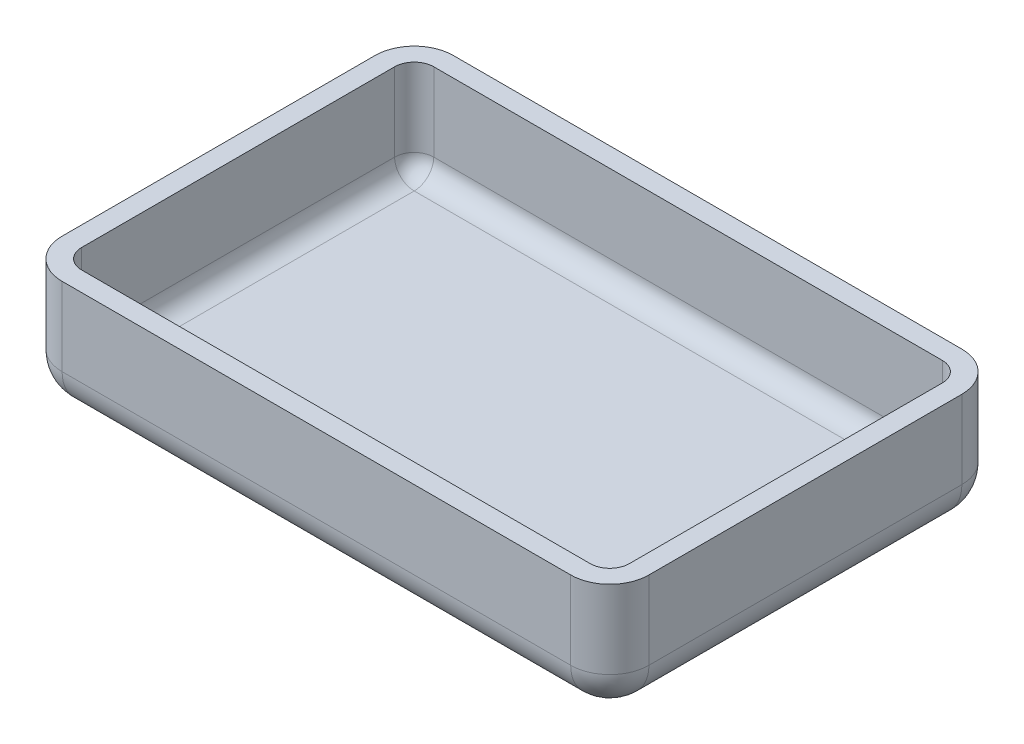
ISO-10303-21;
HEADER;
FILE_DESCRIPTION(('STEP AP214'),'2;1');
FILE_NAME('part.step','',(''),(''),'','','');
FILE_SCHEMA(('AUTOMOTIVE_DESIGN { 1 0 10303 214 1 1 1 1 }'));
ENDSEC;
DATA;
#1=APPLICATION_CONTEXT('core data for automotive mechanical design processes');
#2=APPLICATION_PROTOCOL_DEFINITION('international standard','automotive_design',2000,#1);
#3=PRODUCT_CONTEXT('',#1,'mechanical');
#4=PRODUCT('Part','Part','',(#3));
#5=PRODUCT_RELATED_PRODUCT_CATEGORY('part','',(#4));
#6=PRODUCT_DEFINITION_FORMATION('','',#4);
#7=PRODUCT_DEFINITION_CONTEXT('part definition',#1,'design');
#8=PRODUCT_DEFINITION('design','',#6,#7);
#9=PRODUCT_DEFINITION_SHAPE('','',#8);
#10=(LENGTH_UNIT() NAMED_UNIT(*) SI_UNIT(.MILLI.,.METRE.));
#11=(NAMED_UNIT(*) PLANE_ANGLE_UNIT() SI_UNIT($,.RADIAN.));
#12=(NAMED_UNIT(*) SI_UNIT($,.STERADIAN.) SOLID_ANGLE_UNIT());
#13=UNCERTAINTY_MEASURE_WITH_UNIT(LENGTH_MEASURE(1.E-05),#10,'distance_accuracy_value','');
#14=(GEOMETRIC_REPRESENTATION_CONTEXT(3) GLOBAL_UNCERTAINTY_ASSIGNED_CONTEXT((#13)) GLOBAL_UNIT_ASSIGNED_CONTEXT((#10,
#11,#12)) REPRESENTATION_CONTEXT('',''));
#15=CARTESIAN_POINT('',(0.,0.,0.));
#16=DIRECTION('',(0.,0.,1.));
#17=DIRECTION('',(1.,0.,0.));
#18=AXIS2_PLACEMENT_3D('',#15,#16,#17);
#19=CARTESIAN_POINT('',(-75.,30.,-50.));
#20=DIRECTION('',(1.,0.,0.));
#21=DIRECTION('',(0.,0.,-1.));
#22=AXIS2_PLACEMENT_3D('',#19,#20,#21);
#23=PLANE('',#22);
#24=DIRECTION('',(0.,0.,1.));
#25=VECTOR('',#24,1.);
#26=CARTESIAN_POINT('',(-75.,30.,-50.));
#27=LINE('',#26,#25);
#28=CARTESIAN_POINT('',(-75.,30.,-40.));
#29=VERTEX_POINT('',#28);
#30=CARTESIAN_POINT('',(-75.,30.,40.));
#31=VERTEX_POINT('',#30);
#32=EDGE_CURVE('E307',#29,#31,#27,.T.);
#33=ORIENTED_EDGE('',*,*,#32,.F.);
#34=DIRECTION('',(0.,-1.,0.));
#35=VECTOR('',#34,1.);
#36=CARTESIAN_POINT('',(-75.,30.,-40.));
#37=LINE('',#36,#35);
#38=CARTESIAN_POINT('',(-75.,10.,-40.));
#39=VERTEX_POINT('',#38);
#40=EDGE_CURVE('E54',#29,#39,#37,.T.);
#41=ORIENTED_EDGE('',*,*,#40,.T.);
#42=DIRECTION('',(0.,0.,1.));
#43=VECTOR('',#42,1.);
#44=CARTESIAN_POINT('',(-75.,10.,-50.));
#45=LINE('',#44,#43);
#46=CARTESIAN_POINT('',(-75.,10.,40.));
#47=VERTEX_POINT('',#46);
#48=EDGE_CURVE('E349',#39,#47,#45,.T.);
#49=ORIENTED_EDGE('',*,*,#48,.T.);
#50=DIRECTION('',(0.,-1.,0.));
#51=VECTOR('',#50,1.);
#52=CARTESIAN_POINT('',(-75.,30.,40.));
#53=LINE('',#52,#51);
#54=EDGE_CURVE('E347',#47,#31,#53,.F.);
#55=ORIENTED_EDGE('',*,*,#54,.T.);
#56=EDGE_LOOP('',(#33,#41,#49,#55));
#57=FACE_BOUND('',#56,.T.);
#58=ADVANCED_FACE('F32',(#57),#23,.F.);
#59=CARTESIAN_POINT('',(-75.,30.,50.));
#60=DIRECTION('',(0.,0.,-1.));
#61=DIRECTION('',(-1.,0.,0.));
#62=AXIS2_PLACEMENT_3D('',#59,#60,#61);
#63=PLANE('',#62);
#64=DIRECTION('',(1.,0.,0.));
#65=VECTOR('',#64,1.);
#66=CARTESIAN_POINT('',(-75.,30.,50.));
#67=LINE('',#66,#65);
#68=CARTESIAN_POINT('',(-65.,30.,50.));
#69=VERTEX_POINT('',#68);
#70=CARTESIAN_POINT('',(65.,30.,50.));
#71=VERTEX_POINT('',#70);
#72=EDGE_CURVE('E310',#69,#71,#67,.T.);
#73=ORIENTED_EDGE('',*,*,#72,.F.);
#74=DIRECTION('',(0.,-1.,0.));
#75=VECTOR('',#74,1.);
#76=CARTESIAN_POINT('',(-65.,30.,50.));
#77=LINE('',#76,#75);
#78=CARTESIAN_POINT('',(-65.,10.,50.));
#79=VERTEX_POINT('',#78);
#80=EDGE_CURVE('E324',#69,#79,#77,.T.);
#81=ORIENTED_EDGE('',*,*,#80,.T.);
#82=DIRECTION('',(1.,0.,0.));
#83=VECTOR('',#82,1.);
#84=CARTESIAN_POINT('',(-75.,10.,50.));
#85=LINE('',#84,#83);
#86=CARTESIAN_POINT('',(65.,10.,50.));
#87=VERTEX_POINT('',#86);
#88=EDGE_CURVE('E321',#79,#87,#85,.T.);
#89=ORIENTED_EDGE('',*,*,#88,.T.);
#90=DIRECTION('',(0.,-1.,0.));
#91=VECTOR('',#90,1.);
#92=CARTESIAN_POINT('',(65.,30.,50.));
#93=LINE('',#92,#91);
#94=EDGE_CURVE('E319',#87,#71,#93,.F.);
#95=ORIENTED_EDGE('',*,*,#94,.T.);
#96=EDGE_LOOP('',(#73,#81,#89,#95));
#97=FACE_BOUND('',#96,.T.);
#98=ADVANCED_FACE('F364',(#97),#63,.F.);
#99=CARTESIAN_POINT('',(75.,30.,-50.));
#100=DIRECTION('',(-1.,0.,0.));
#101=DIRECTION('',(0.,0.,1.));
#102=AXIS2_PLACEMENT_3D('',#99,#100,#101);
#103=PLANE('',#102);
#104=DIRECTION('',(0.,0.,-1.));
#105=VECTOR('',#104,1.);
#106=CARTESIAN_POINT('',(75.,10.,-50.));
#107=LINE('',#106,#105);
#108=CARTESIAN_POINT('',(75.,10.,40.));
#109=VERTEX_POINT('',#108);
#110=CARTESIAN_POINT('',(75.,10.,-40.));
#111=VERTEX_POINT('',#110);
#112=EDGE_CURVE('E337',#109,#111,#107,.T.);
#113=ORIENTED_EDGE('',*,*,#112,.T.);
#114=DIRECTION('',(0.,-1.,0.));
#115=VECTOR('',#114,1.);
#116=CARTESIAN_POINT('',(75.,30.,-40.));
#117=LINE('',#116,#115);
#118=CARTESIAN_POINT('',(75.,30.,-40.));
#119=VERTEX_POINT('',#118);
#120=EDGE_CURVE('E339',#111,#119,#117,.F.);
#121=ORIENTED_EDGE('',*,*,#120,.T.);
#122=DIRECTION('',(0.,0.,-1.));
#123=VECTOR('',#122,1.);
#124=CARTESIAN_POINT('',(75.,30.,-50.));
#125=LINE('',#124,#123);
#126=CARTESIAN_POINT('',(75.,30.,40.));
#127=VERTEX_POINT('',#126);
#128=EDGE_CURVE('E313',#127,#119,#125,.T.);
#129=ORIENTED_EDGE('',*,*,#128,.F.);
#130=DIRECTION('',(0.,-1.,0.));
#131=VECTOR('',#130,1.);
#132=CARTESIAN_POINT('',(75.,30.,40.));
#133=LINE('',#132,#131);
#134=EDGE_CURVE('E335',#127,#109,#133,.T.);
#135=ORIENTED_EDGE('',*,*,#134,.T.);
#136=EDGE_LOOP('',(#113,#121,#129,#135));
#137=FACE_BOUND('',#136,.T.);
#138=ADVANCED_FACE('F388',(#137),#103,.F.);
#139=CARTESIAN_POINT('',(-75.,30.,-50.));
#140=DIRECTION('',(0.,0.,1.));
#141=DIRECTION('',(1.,0.,0.));
#142=AXIS2_PLACEMENT_3D('',#139,#140,#141);
#143=PLANE('',#142);
#144=DIRECTION('',(-1.,0.,0.));
#145=VECTOR('',#144,1.);
#146=CARTESIAN_POINT('',(-75.,10.,-50.));
#147=LINE('',#146,#145);
#148=CARTESIAN_POINT('',(65.,10.,-50.));
#149=VERTEX_POINT('',#148);
#150=CARTESIAN_POINT('',(-65.,10.,-50.));
#151=VERTEX_POINT('',#150);
#152=EDGE_CURVE('E343',#149,#151,#147,.T.);
#153=ORIENTED_EDGE('',*,*,#152,.T.);
#154=DIRECTION('',(0.,-1.,0.));
#155=VECTOR('',#154,1.);
#156=CARTESIAN_POINT('',(-65.,30.,-50.));
#157=LINE('',#156,#155);
#158=CARTESIAN_POINT('',(-65.,30.,-50.));
#159=VERTEX_POINT('',#158);
#160=EDGE_CURVE('E345',#151,#159,#157,.F.);
#161=ORIENTED_EDGE('',*,*,#160,.T.);
#162=DIRECTION('',(-1.,0.,0.));
#163=VECTOR('',#162,1.);
#164=CARTESIAN_POINT('',(-75.,30.,-50.));
#165=LINE('',#164,#163);
#166=CARTESIAN_POINT('',(65.,30.,-50.));
#167=VERTEX_POINT('',#166);
#168=EDGE_CURVE('E316',#167,#159,#165,.T.);
#169=ORIENTED_EDGE('',*,*,#168,.F.);
#170=DIRECTION('',(0.,-1.,0.));
#171=VECTOR('',#170,1.);
#172=CARTESIAN_POINT('',(65.,30.,-50.));
#173=LINE('',#172,#171);
#174=EDGE_CURVE('E341',#167,#149,#173,.T.);
#175=ORIENTED_EDGE('',*,*,#174,.T.);
#176=EDGE_LOOP('',(#153,#161,#169,#175));
#177=FACE_BOUND('',#176,.T.);
#178=ADVANCED_FACE('F411',(#177),#143,.F.);
#179=CARTESIAN_POINT('',(-75.,30.,50.));
#180=DIRECTION('',(0.,1.,0.));
#181=DIRECTION('',(0.,0.,1.));
#182=AXIS2_PLACEMENT_3D('',#179,#180,#181);
#183=PLANE('',#182);
#184=DIRECTION('',(-1.,0.,0.));
#185=VECTOR('',#184,1.);
#186=CARTESIAN_POINT('',(-75.,30.,-45.));
#187=LINE('',#186,#185);
#188=CARTESIAN_POINT('',(65.,30.,-45.));
#189=VERTEX_POINT('',#188);
#190=CARTESIAN_POINT('',(-65.,30.,-45.));
#191=VERTEX_POINT('',#190);
#192=EDGE_CURVE('E250',#189,#191,#187,.T.);
#193=ORIENTED_EDGE('',*,*,#192,.F.);
#194=CARTESIAN_POINT('',(65.,30.,-40.));
#195=DIRECTION('',(0.,1.,0.));
#196=DIRECTION('',(0.,0.,1.));
#197=AXIS2_PLACEMENT_3D('',#194,#195,#196);
#198=CIRCLE('',#197,5.);
#199=CARTESIAN_POINT('',(70.,30.,-40.));
#200=VERTEX_POINT('',#199);
#201=EDGE_CURVE('E264',#200,#189,#198,.T.);
#202=ORIENTED_EDGE('',*,*,#201,.F.);
#203=DIRECTION('',(0.,0.,-1.));
#204=VECTOR('',#203,1.);
#205=CARTESIAN_POINT('',(70.,30.,-50.));
#206=LINE('',#205,#204);
#207=CARTESIAN_POINT('',(70.,30.,40.));
#208=VERTEX_POINT('',#207);
#209=EDGE_CURVE('E46',#208,#200,#206,.T.);
#210=ORIENTED_EDGE('',*,*,#209,.F.);
#211=CARTESIAN_POINT('',(65.,30.,40.));
#212=DIRECTION('',(0.,1.,0.));
#213=DIRECTION('',(0.,0.,1.));
#214=AXIS2_PLACEMENT_3D('',#211,#212,#213);
#215=CIRCLE('',#214,5.);
#216=CARTESIAN_POINT('',(65.,30.,45.));
#217=VERTEX_POINT('',#216);
#218=EDGE_CURVE('E180',#217,#208,#215,.T.);
#219=ORIENTED_EDGE('',*,*,#218,.F.);
#220=DIRECTION('',(1.,0.,0.));
#221=VECTOR('',#220,1.);
#222=CARTESIAN_POINT('',(-75.,30.,45.));
#223=LINE('',#222,#221);
#224=CARTESIAN_POINT('',(-65.,30.,45.));
#225=VERTEX_POINT('',#224);
#226=EDGE_CURVE('E261',#225,#217,#223,.T.);
#227=ORIENTED_EDGE('',*,*,#226,.F.);
#228=CARTESIAN_POINT('',(-65.,30.,40.));
#229=DIRECTION('',(0.,1.,0.));
#230=DIRECTION('',(0.,0.,1.));
#231=AXIS2_PLACEMENT_3D('',#228,#229,#230);
#232=CIRCLE('',#231,5.);
#233=CARTESIAN_POINT('',(-70.,30.,40.));
#234=VERTEX_POINT('',#233);
#235=EDGE_CURVE('E262',#234,#225,#232,.T.);
#236=ORIENTED_EDGE('',*,*,#235,.F.);
#237=DIRECTION('',(0.,0.,1.));
#238=VECTOR('',#237,1.);
#239=CARTESIAN_POINT('',(-70.,30.,-50.));
#240=LINE('',#239,#238);
#241=CARTESIAN_POINT('',(-70.,30.,-40.));
#242=VERTEX_POINT('',#241);
#243=EDGE_CURVE('E237',#242,#234,#240,.T.);
#244=ORIENTED_EDGE('',*,*,#243,.F.);
#245=CARTESIAN_POINT('',(-65.,30.,-40.));
#246=DIRECTION('',(0.,1.,0.));
#247=DIRECTION('',(0.,0.,1.));
#248=AXIS2_PLACEMENT_3D('',#245,#246,#247);
#249=CIRCLE('',#248,5.);
#250=EDGE_CURVE('E175',#191,#242,#249,.T.);
#251=ORIENTED_EDGE('',*,*,#250,.F.);
#252=EDGE_LOOP('',(#193,#202,#210,#219,#227,#236,#244,#251));
#253=FACE_BOUND('',#252,.T.);
#254=ORIENTED_EDGE('',*,*,#168,.T.);
#255=CARTESIAN_POINT('',(-65.,30.,-40.));
#256=DIRECTION('',(0.,1.,0.));
#257=DIRECTION('',(0.,0.,1.));
#258=AXIS2_PLACEMENT_3D('',#255,#256,#257);
#259=CIRCLE('',#258,10.);
#260=EDGE_CURVE('E11',#159,#29,#259,.T.);
#261=ORIENTED_EDGE('',*,*,#260,.T.);
#262=ORIENTED_EDGE('',*,*,#32,.T.);
#263=CARTESIAN_POINT('',(-65.,30.,40.));
#264=DIRECTION('',(0.,1.,0.));
#265=DIRECTION('',(0.,0.,1.));
#266=AXIS2_PLACEMENT_3D('',#263,#264,#265);
#267=CIRCLE('',#266,10.);
#268=EDGE_CURVE('E39',#31,#69,#267,.T.);
#269=ORIENTED_EDGE('',*,*,#268,.T.);
#270=ORIENTED_EDGE('',*,*,#72,.T.);
#271=CARTESIAN_POINT('',(65.,30.,40.));
#272=DIRECTION('',(0.,1.,0.));
#273=DIRECTION('',(0.,0.,1.));
#274=AXIS2_PLACEMENT_3D('',#271,#272,#273);
#275=CIRCLE('',#274,10.);
#276=EDGE_CURVE('E352',#71,#127,#275,.T.);
#277=ORIENTED_EDGE('',*,*,#276,.T.);
#278=ORIENTED_EDGE('',*,*,#128,.T.);
#279=CARTESIAN_POINT('',(65.,30.,-40.));
#280=DIRECTION('',(0.,1.,0.));
#281=DIRECTION('',(0.,0.,1.));
#282=AXIS2_PLACEMENT_3D('',#279,#280,#281);
#283=CIRCLE('',#282,10.);
#284=EDGE_CURVE('E354',#119,#167,#283,.T.);
#285=ORIENTED_EDGE('',*,*,#284,.T.);
#286=EDGE_LOOP('',(#254,#261,#262,#269,#270,#277,#278,#285));
#287=FACE_BOUND('',#286,.T.);
#288=ADVANCED_FACE('F358',(#253,#287),#183,.T.);
#289=CARTESIAN_POINT('',(-75.,0.,50.));
#290=DIRECTION('',(0.,1.,0.));
#291=DIRECTION('',(0.,0.,1.));
#292=AXIS2_PLACEMENT_3D('',#289,#290,#291);
#293=PLANE('',#292);
#294=DIRECTION('',(0.,0.,-1.));
#295=VECTOR('',#294,1.);
#296=CARTESIAN_POINT('',(65.,0.,50.));
#297=LINE('',#296,#295);
#298=CARTESIAN_POINT('',(65.,0.,-40.));
#299=VERTEX_POINT('',#298);
#300=CARTESIAN_POINT('',(65.,0.,40.));
#301=VERTEX_POINT('',#300);
#302=EDGE_CURVE('E330',#299,#301,#297,.F.);
#303=ORIENTED_EDGE('',*,*,#302,.T.);
#304=DIRECTION('',(1.,0.,0.));
#305=VECTOR('',#304,1.);
#306=CARTESIAN_POINT('',(-75.,0.,40.));
#307=LINE('',#306,#305);
#308=CARTESIAN_POINT('',(-65.,0.,40.));
#309=VERTEX_POINT('',#308);
#310=EDGE_CURVE('E332',#301,#309,#307,.F.);
#311=ORIENTED_EDGE('',*,*,#310,.T.);
#312=DIRECTION('',(0.,0.,1.));
#313=VECTOR('',#312,1.);
#314=CARTESIAN_POINT('',(-65.,0.,50.));
#315=LINE('',#314,#313);
#316=CARTESIAN_POINT('',(-65.,0.,-40.));
#317=VERTEX_POINT('',#316);
#318=EDGE_CURVE('E326',#309,#317,#315,.F.);
#319=ORIENTED_EDGE('',*,*,#318,.T.);
#320=DIRECTION('',(-1.,0.,0.));
#321=VECTOR('',#320,1.);
#322=CARTESIAN_POINT('',(-75.,0.,-40.));
#323=LINE('',#322,#321);
#324=EDGE_CURVE('E328',#317,#299,#323,.F.);
#325=ORIENTED_EDGE('',*,*,#324,.T.);
#326=EDGE_LOOP('',(#303,#311,#319,#325));
#327=FACE_BOUND('',#326,.T.);
#328=ADVANCED_FACE('F403',(#327),#293,.F.);
#329=CARTESIAN_POINT('',(-65.,30.,-40.));
#330=DIRECTION('',(0.,-1.,0.));
#331=DIRECTION('',(0.,0.,-1.));
#332=AXIS2_PLACEMENT_3D('',#329,#330,#331);
#333=CYLINDRICAL_SURFACE('',#332,10.);
#334=ORIENTED_EDGE('',*,*,#260,.F.);
#335=ORIENTED_EDGE('',*,*,#160,.F.);
#336=CARTESIAN_POINT('',(-65.,10.,-40.));
#337=DIRECTION('',(0.,-1.,0.));
#338=DIRECTION('',(0.,0.,-1.));
#339=AXIS2_PLACEMENT_3D('',#336,#337,#338);
#340=CIRCLE('',#339,10.);
#341=EDGE_CURVE('E301',#39,#151,#340,.T.);
#342=ORIENTED_EDGE('',*,*,#341,.F.);
#343=ORIENTED_EDGE('',*,*,#40,.F.);
#344=EDGE_LOOP('',(#334,#335,#342,#343));
#345=FACE_BOUND('',#344,.T.);
#346=ADVANCED_FACE('F415',(#345),#333,.T.);
#347=CARTESIAN_POINT('',(65.,30.,-40.));
#348=DIRECTION('',(0.,-1.,0.));
#349=DIRECTION('',(0.,0.,-1.));
#350=AXIS2_PLACEMENT_3D('',#347,#348,#349);
#351=CYLINDRICAL_SURFACE('',#350,10.);
#352=ORIENTED_EDGE('',*,*,#284,.F.);
#353=ORIENTED_EDGE('',*,*,#120,.F.);
#354=CARTESIAN_POINT('',(65.,10.,-40.));
#355=DIRECTION('',(0.,-1.,0.));
#356=DIRECTION('',(0.,0.,-1.));
#357=AXIS2_PLACEMENT_3D('',#354,#355,#356);
#358=CIRCLE('',#357,10.);
#359=EDGE_CURVE('E298',#149,#111,#358,.T.);
#360=ORIENTED_EDGE('',*,*,#359,.F.);
#361=ORIENTED_EDGE('',*,*,#174,.F.);
#362=EDGE_LOOP('',(#352,#353,#360,#361));
#363=FACE_BOUND('',#362,.T.);
#364=ADVANCED_FACE('F393',(#363),#351,.T.);
#365=CARTESIAN_POINT('',(-75.,10.,-40.));
#366=DIRECTION('',(-1.,0.,0.));
#367=DIRECTION('',(0.,0.,1.));
#368=AXIS2_PLACEMENT_3D('',#365,#366,#367);
#369=CYLINDRICAL_SURFACE('',#368,10.);
#370=CARTESIAN_POINT('',(-65.,10.,-40.));
#371=DIRECTION('',(-1.,0.,0.));
#372=DIRECTION('',(0.,0.,1.));
#373=AXIS2_PLACEMENT_3D('',#370,#371,#372);
#374=CIRCLE('',#373,10.);
#375=EDGE_CURVE('E304',#151,#317,#374,.T.);
#376=ORIENTED_EDGE('',*,*,#375,.F.);
#377=ORIENTED_EDGE('',*,*,#152,.F.);
#378=CARTESIAN_POINT('',(65.,10.,-40.));
#379=DIRECTION('',(1.,0.,0.));
#380=DIRECTION('',(0.,0.,-1.));
#381=AXIS2_PLACEMENT_3D('',#378,#379,#380);
#382=CIRCLE('',#381,10.);
#383=EDGE_CURVE('E295',#299,#149,#382,.T.);
#384=ORIENTED_EDGE('',*,*,#383,.F.);
#385=ORIENTED_EDGE('',*,*,#324,.F.);
#386=EDGE_LOOP('',(#376,#377,#384,#385));
#387=FACE_BOUND('',#386,.T.);
#388=ADVANCED_FACE('F408',(#387),#369,.T.);
#389=CARTESIAN_POINT('',(-65.,10.,-40.));
#390=DIRECTION('',(0.,0.,1.));
#391=DIRECTION('',(1.,0.,0.));
#392=AXIS2_PLACEMENT_3D('',#389,#390,#391);
#393=SPHERICAL_SURFACE('',#392,10.);
#394=ORIENTED_EDGE('',*,*,#341,.T.);
#395=ORIENTED_EDGE('',*,*,#375,.T.);
#396=CARTESIAN_POINT('',(-65.,10.,-40.));
#397=DIRECTION('',(0.,0.,-1.));
#398=DIRECTION('',(-1.,0.,0.));
#399=AXIS2_PLACEMENT_3D('',#396,#397,#398);
#400=CIRCLE('',#399,10.);
#401=EDGE_CURVE('E292',#39,#317,#400,.F.);
#402=ORIENTED_EDGE('',*,*,#401,.F.);
#403=EDGE_LOOP('',(#394,#395,#402));
#404=FACE_BOUND('',#403,.T.);
#405=ADVANCED_FACE('F421',(#404),#393,.T.);
#406=CARTESIAN_POINT('',(65.,10.,-40.));
#407=DIRECTION('',(0.,0.,1.));
#408=DIRECTION('',(1.,0.,0.));
#409=AXIS2_PLACEMENT_3D('',#406,#407,#408);
#410=SPHERICAL_SURFACE('',#409,10.);
#411=ORIENTED_EDGE('',*,*,#383,.T.);
#412=ORIENTED_EDGE('',*,*,#359,.T.);
#413=CARTESIAN_POINT('',(65.,10.,-40.));
#414=DIRECTION('',(0.,0.,-1.));
#415=DIRECTION('',(-1.,0.,0.));
#416=AXIS2_PLACEMENT_3D('',#413,#414,#415);
#417=CIRCLE('',#416,10.);
#418=EDGE_CURVE('E289',#299,#111,#417,.F.);
#419=ORIENTED_EDGE('',*,*,#418,.F.);
#420=EDGE_LOOP('',(#411,#412,#419));
#421=FACE_BOUND('',#420,.T.);
#422=ADVANCED_FACE('F397',(#421),#410,.T.);
#423=CARTESIAN_POINT('',(-65.,10.,-50.));
#424=DIRECTION('',(0.,0.,1.));
#425=DIRECTION('',(1.,0.,0.));
#426=AXIS2_PLACEMENT_3D('',#423,#424,#425);
#427=CYLINDRICAL_SURFACE('',#426,10.);
#428=ORIENTED_EDGE('',*,*,#401,.T.);
#429=ORIENTED_EDGE('',*,*,#318,.F.);
#430=CARTESIAN_POINT('',(-65.,10.,40.));
#431=DIRECTION('',(0.,0.,1.));
#432=DIRECTION('',(1.,0.,0.));
#433=AXIS2_PLACEMENT_3D('',#430,#431,#432);
#434=CIRCLE('',#433,10.);
#435=EDGE_CURVE('E286',#47,#309,#434,.T.);
#436=ORIENTED_EDGE('',*,*,#435,.F.);
#437=ORIENTED_EDGE('',*,*,#48,.F.);
#438=EDGE_LOOP('',(#428,#429,#436,#437));
#439=FACE_BOUND('',#438,.T.);
#440=ADVANCED_FACE('F419',(#439),#427,.T.);
#441=CARTESIAN_POINT('',(-65.,30.,40.));
#442=DIRECTION('',(0.,-1.,0.));
#443=DIRECTION('',(0.,0.,-1.));
#444=AXIS2_PLACEMENT_3D('',#441,#442,#443);
#445=CYLINDRICAL_SURFACE('',#444,10.);
#446=ORIENTED_EDGE('',*,*,#268,.F.);
#447=ORIENTED_EDGE('',*,*,#54,.F.);
#448=CARTESIAN_POINT('',(-65.,10.,40.));
#449=DIRECTION('',(0.,-1.,0.));
#450=DIRECTION('',(0.,0.,-1.));
#451=AXIS2_PLACEMENT_3D('',#448,#449,#450);
#452=CIRCLE('',#451,10.);
#453=EDGE_CURVE('E283',#79,#47,#452,.T.);
#454=ORIENTED_EDGE('',*,*,#453,.F.);
#455=ORIENTED_EDGE('',*,*,#80,.F.);
#456=EDGE_LOOP('',(#446,#447,#454,#455));
#457=FACE_BOUND('',#456,.T.);
#458=ADVANCED_FACE('F367',(#457),#445,.T.);
#459=CARTESIAN_POINT('',(65.,30.,40.));
#460=DIRECTION('',(0.,-1.,0.));
#461=DIRECTION('',(0.,0.,-1.));
#462=AXIS2_PLACEMENT_3D('',#459,#460,#461);
#463=CYLINDRICAL_SURFACE('',#462,10.);
#464=ORIENTED_EDGE('',*,*,#276,.F.);
#465=ORIENTED_EDGE('',*,*,#94,.F.);
#466=CARTESIAN_POINT('',(65.,10.,40.));
#467=DIRECTION('',(0.,-1.,0.));
#468=DIRECTION('',(0.,0.,-1.));
#469=AXIS2_PLACEMENT_3D('',#466,#467,#468);
#470=CIRCLE('',#469,10.);
#471=EDGE_CURVE('E280',#109,#87,#470,.T.);
#472=ORIENTED_EDGE('',*,*,#471,.F.);
#473=ORIENTED_EDGE('',*,*,#134,.F.);
#474=EDGE_LOOP('',(#464,#465,#472,#473));
#475=FACE_BOUND('',#474,.T.);
#476=ADVANCED_FACE('F384',(#475),#463,.T.);
#477=CARTESIAN_POINT('',(65.,10.,-50.));
#478=DIRECTION('',(0.,0.,-1.));
#479=DIRECTION('',(-1.,0.,0.));
#480=AXIS2_PLACEMENT_3D('',#477,#478,#479);
#481=CYLINDRICAL_SURFACE('',#480,10.);
#482=ORIENTED_EDGE('',*,*,#418,.T.);
#483=ORIENTED_EDGE('',*,*,#112,.F.);
#484=CARTESIAN_POINT('',(65.,10.,40.));
#485=DIRECTION('',(0.,0.,1.));
#486=DIRECTION('',(1.,0.,0.));
#487=AXIS2_PLACEMENT_3D('',#484,#485,#486);
#488=CIRCLE('',#487,10.);
#489=EDGE_CURVE('E277',#301,#109,#488,.T.);
#490=ORIENTED_EDGE('',*,*,#489,.F.);
#491=ORIENTED_EDGE('',*,*,#302,.F.);
#492=EDGE_LOOP('',(#482,#483,#490,#491));
#493=FACE_BOUND('',#492,.T.);
#494=ADVANCED_FACE('F401',(#493),#481,.T.);
#495=CARTESIAN_POINT('',(-65.,10.,40.));
#496=DIRECTION('',(0.,0.,1.));
#497=DIRECTION('',(1.,0.,0.));
#498=AXIS2_PLACEMENT_3D('',#495,#496,#497);
#499=SPHERICAL_SURFACE('',#498,10.);
#500=ORIENTED_EDGE('',*,*,#453,.T.);
#501=ORIENTED_EDGE('',*,*,#435,.T.);
#502=CARTESIAN_POINT('',(-65.,10.,40.));
#503=DIRECTION('',(-1.,0.,0.));
#504=DIRECTION('',(0.,0.,1.));
#505=AXIS2_PLACEMENT_3D('',#502,#503,#504);
#506=CIRCLE('',#505,10.);
#507=EDGE_CURVE('E275',#79,#309,#506,.F.);
#508=ORIENTED_EDGE('',*,*,#507,.F.);
#509=EDGE_LOOP('',(#500,#501,#508));
#510=FACE_BOUND('',#509,.T.);
#511=ADVANCED_FACE('F372',(#510),#499,.T.);
#512=CARTESIAN_POINT('',(65.,10.,40.));
#513=DIRECTION('',(0.,0.,1.));
#514=DIRECTION('',(1.,0.,0.));
#515=AXIS2_PLACEMENT_3D('',#512,#513,#514);
#516=SPHERICAL_SURFACE('',#515,10.);
#517=ORIENTED_EDGE('',*,*,#489,.T.);
#518=ORIENTED_EDGE('',*,*,#471,.T.);
#519=CARTESIAN_POINT('',(65.,10.,40.));
#520=DIRECTION('',(1.,0.,0.));
#521=DIRECTION('',(0.,0.,-1.));
#522=AXIS2_PLACEMENT_3D('',#519,#520,#521);
#523=CIRCLE('',#522,10.);
#524=EDGE_CURVE('E273',#301,#87,#523,.F.);
#525=ORIENTED_EDGE('',*,*,#524,.F.);
#526=EDGE_LOOP('',(#517,#518,#525));
#527=FACE_BOUND('',#526,.T.);
#528=ADVANCED_FACE('F380',(#527),#516,.T.);
#529=CARTESIAN_POINT('',(-75.,10.,40.));
#530=DIRECTION('',(1.,0.,0.));
#531=DIRECTION('',(0.,0.,-1.));
#532=AXIS2_PLACEMENT_3D('',#529,#530,#531);
#533=CYLINDRICAL_SURFACE('',#532,10.);
#534=ORIENTED_EDGE('',*,*,#507,.T.);
#535=ORIENTED_EDGE('',*,*,#310,.F.);
#536=ORIENTED_EDGE('',*,*,#524,.T.);
#537=ORIENTED_EDGE('',*,*,#88,.F.);
#538=EDGE_LOOP('',(#534,#535,#536,#537));
#539=FACE_BOUND('',#538,.T.);
#540=ADVANCED_FACE('F376',(#539),#533,.T.);
#541=CARTESIAN_POINT('',(-70.,30.,-50.));
#542=DIRECTION('',(1.,0.,0.));
#543=DIRECTION('',(0.,0.,-1.));
#544=AXIS2_PLACEMENT_3D('',#541,#542,#543);
#545=PLANE('',#544);
#546=ORIENTED_EDGE('',*,*,#243,.T.);
#547=DIRECTION('',(0.,1.,0.));
#548=VECTOR('',#547,1.);
#549=CARTESIAN_POINT('',(-70.,30.,40.));
#550=LINE('',#549,#548);
#551=CARTESIAN_POINT('',(-70.,10.,40.));
#552=VERTEX_POINT('',#551);
#553=EDGE_CURVE('E204',#552,#234,#550,.T.);
#554=ORIENTED_EDGE('',*,*,#553,.F.);
#555=DIRECTION('',(0.,0.,-1.));
#556=VECTOR('',#555,1.);
#557=CARTESIAN_POINT('',(-70.,10.,-50.));
#558=LINE('',#557,#556);
#559=CARTESIAN_POINT('',(-70.,10.,-40.));
#560=VERTEX_POINT('',#559);
#561=EDGE_CURVE('E181',#560,#552,#558,.F.);
#562=ORIENTED_EDGE('',*,*,#561,.F.);
#563=DIRECTION('',(0.,1.,0.));
#564=VECTOR('',#563,1.);
#565=CARTESIAN_POINT('',(-70.,30.,-40.));
#566=LINE('',#565,#564);
#567=EDGE_CURVE('E170',#242,#560,#566,.F.);
#568=ORIENTED_EDGE('',*,*,#567,.F.);
#569=EDGE_LOOP('',(#546,#554,#562,#568));
#570=FACE_BOUND('',#569,.T.);
#571=ADVANCED_FACE('F203',(#570),#545,.T.);
#572=CARTESIAN_POINT('',(-75.,30.,45.));
#573=DIRECTION('',(0.,0.,-1.));
#574=DIRECTION('',(-1.,0.,0.));
#575=AXIS2_PLACEMENT_3D('',#572,#573,#574);
#576=PLANE('',#575);
#577=ORIENTED_EDGE('',*,*,#226,.T.);
#578=DIRECTION('',(0.,1.,0.));
#579=VECTOR('',#578,1.);
#580=CARTESIAN_POINT('',(65.,30.,45.));
#581=LINE('',#580,#579);
#582=CARTESIAN_POINT('',(65.,10.,45.));
#583=VERTEX_POINT('',#582);
#584=EDGE_CURVE('E248',#583,#217,#581,.T.);
#585=ORIENTED_EDGE('',*,*,#584,.F.);
#586=DIRECTION('',(-1.,0.,0.));
#587=VECTOR('',#586,1.);
#588=CARTESIAN_POINT('',(-75.,10.,45.));
#589=LINE('',#588,#587);
#590=CARTESIAN_POINT('',(-65.,10.,45.));
#591=VERTEX_POINT('',#590);
#592=EDGE_CURVE('E245',#591,#583,#589,.F.);
#593=ORIENTED_EDGE('',*,*,#592,.F.);
#594=DIRECTION('',(0.,1.,0.));
#595=VECTOR('',#594,1.);
#596=CARTESIAN_POINT('',(-65.,30.,45.));
#597=LINE('',#596,#595);
#598=EDGE_CURVE('E235',#225,#591,#597,.F.);
#599=ORIENTED_EDGE('',*,*,#598,.F.);
#600=EDGE_LOOP('',(#577,#585,#593,#599));
#601=FACE_BOUND('',#600,.T.);
#602=ADVANCED_FACE('F540',(#601),#576,.T.);
#603=CARTESIAN_POINT('',(70.,30.,-50.));
#604=DIRECTION('',(-1.,0.,0.));
#605=DIRECTION('',(0.,0.,1.));
#606=AXIS2_PLACEMENT_3D('',#603,#604,#605);
#607=PLANE('',#606);
#608=DIRECTION('',(0.,0.,1.));
#609=VECTOR('',#608,1.);
#610=CARTESIAN_POINT('',(70.,10.,-50.));
#611=LINE('',#610,#609);
#612=CARTESIAN_POINT('',(70.,10.,40.));
#613=VERTEX_POINT('',#612);
#614=CARTESIAN_POINT('',(70.,10.,-40.));
#615=VERTEX_POINT('',#614);
#616=EDGE_CURVE('E217',#613,#615,#611,.F.);
#617=ORIENTED_EDGE('',*,*,#616,.F.);
#618=DIRECTION('',(0.,1.,0.));
#619=VECTOR('',#618,1.);
#620=CARTESIAN_POINT('',(70.,30.,40.));
#621=LINE('',#620,#619);
#622=EDGE_CURVE('E221',#208,#613,#621,.F.);
#623=ORIENTED_EDGE('',*,*,#622,.F.);
#624=ORIENTED_EDGE('',*,*,#209,.T.);
#625=DIRECTION('',(0.,1.,0.));
#626=VECTOR('',#625,1.);
#627=CARTESIAN_POINT('',(70.,30.,-40.));
#628=LINE('',#627,#626);
#629=EDGE_CURVE('E215',#615,#200,#628,.T.);
#630=ORIENTED_EDGE('',*,*,#629,.F.);
#631=EDGE_LOOP('',(#617,#623,#624,#630));
#632=FACE_BOUND('',#631,.T.);
#633=ADVANCED_FACE('F549',(#632),#607,.T.);
#634=CARTESIAN_POINT('',(-75.,30.,-45.));
#635=DIRECTION('',(0.,0.,1.));
#636=DIRECTION('',(1.,0.,0.));
#637=AXIS2_PLACEMENT_3D('',#634,#635,#636);
#638=PLANE('',#637);
#639=DIRECTION('',(1.,0.,0.));
#640=VECTOR('',#639,1.);
#641=CARTESIAN_POINT('',(-75.,10.,-45.));
#642=LINE('',#641,#640);
#643=CARTESIAN_POINT('',(65.,10.,-45.));
#644=VERTEX_POINT('',#643);
#645=CARTESIAN_POINT('',(-65.,10.,-45.));
#646=VERTEX_POINT('',#645);
#647=EDGE_CURVE('E210',#644,#646,#642,.F.);
#648=ORIENTED_EDGE('',*,*,#647,.F.);
#649=DIRECTION('',(0.,1.,0.));
#650=VECTOR('',#649,1.);
#651=CARTESIAN_POINT('',(65.,30.,-45.));
#652=LINE('',#651,#650);
#653=EDGE_CURVE('E213',#189,#644,#652,.F.);
#654=ORIENTED_EDGE('',*,*,#653,.F.);
#655=ORIENTED_EDGE('',*,*,#192,.T.);
#656=DIRECTION('',(0.,1.,0.));
#657=VECTOR('',#656,1.);
#658=CARTESIAN_POINT('',(-65.,30.,-45.));
#659=LINE('',#658,#657);
#660=EDGE_CURVE('E207',#646,#191,#659,.T.);
#661=ORIENTED_EDGE('',*,*,#660,.F.);
#662=EDGE_LOOP('',(#648,#654,#655,#661));
#663=FACE_BOUND('',#662,.T.);
#664=ADVANCED_FACE('F559',(#663),#638,.T.);
#665=CARTESIAN_POINT('',(-75.,5.,50.));
#666=DIRECTION('',(0.,1.,0.));
#667=DIRECTION('',(0.,0.,1.));
#668=AXIS2_PLACEMENT_3D('',#665,#666,#667);
#669=PLANE('',#668);
#670=DIRECTION('',(0.,0.,1.));
#671=VECTOR('',#670,1.);
#672=CARTESIAN_POINT('',(65.,5.,50.));
#673=LINE('',#672,#671);
#674=CARTESIAN_POINT('',(65.,5.,-40.));
#675=VERTEX_POINT('',#674);
#676=CARTESIAN_POINT('',(65.,5.,40.));
#677=VERTEX_POINT('',#676);
#678=EDGE_CURVE('E229',#675,#677,#673,.T.);
#679=ORIENTED_EDGE('',*,*,#678,.F.);
#680=DIRECTION('',(1.,0.,0.));
#681=VECTOR('',#680,1.);
#682=CARTESIAN_POINT('',(-75.,5.,-40.));
#683=LINE('',#682,#681);
#684=CARTESIAN_POINT('',(-65.,5.,-40.));
#685=VERTEX_POINT('',#684);
#686=EDGE_CURVE('E231',#685,#675,#683,.T.);
#687=ORIENTED_EDGE('',*,*,#686,.F.);
#688=DIRECTION('',(0.,0.,1.));
#689=VECTOR('',#688,1.);
#690=CARTESIAN_POINT('',(-65.,5.,50.));
#691=LINE('',#690,#689);
#692=CARTESIAN_POINT('',(-65.,5.,40.));
#693=VERTEX_POINT('',#692);
#694=EDGE_CURVE('E198',#693,#685,#691,.F.);
#695=ORIENTED_EDGE('',*,*,#694,.F.);
#696=DIRECTION('',(1.,0.,0.));
#697=VECTOR('',#696,1.);
#698=CARTESIAN_POINT('',(-75.,5.,40.));
#699=LINE('',#698,#697);
#700=EDGE_CURVE('E223',#677,#693,#699,.F.);
#701=ORIENTED_EDGE('',*,*,#700,.F.);
#702=EDGE_LOOP('',(#679,#687,#695,#701));
#703=FACE_BOUND('',#702,.T.);
#704=ADVANCED_FACE('F568',(#703),#669,.T.);
#705=CARTESIAN_POINT('',(-65.,30.,-40.));
#706=DIRECTION('',(0.,-1.,0.));
#707=DIRECTION('',(0.,0.,-1.));
#708=AXIS2_PLACEMENT_3D('',#705,#706,#707);
#709=CYLINDRICAL_SURFACE('',#708,5.);
#710=ORIENTED_EDGE('',*,*,#250,.T.);
#711=ORIENTED_EDGE('',*,*,#567,.T.);
#712=CARTESIAN_POINT('',(-65.,10.,-40.));
#713=DIRECTION('',(0.,1.,0.));
#714=DIRECTION('',(-1.,0.,0.));
#715=AXIS2_PLACEMENT_3D('',#712,#713,#714);
#716=CIRCLE('',#715,5.);
#717=EDGE_CURVE('E173',#560,#646,#716,.F.);
#718=ORIENTED_EDGE('',*,*,#717,.T.);
#719=ORIENTED_EDGE('',*,*,#660,.T.);
#720=EDGE_LOOP('',(#710,#711,#718,#719));
#721=FACE_BOUND('',#720,.T.);
#722=ADVANCED_FACE('F172',(#721),#709,.F.);
#723=CARTESIAN_POINT('',(65.,30.,-40.));
#724=DIRECTION('',(0.,-1.,0.));
#725=DIRECTION('',(0.,0.,-1.));
#726=AXIS2_PLACEMENT_3D('',#723,#724,#725);
#727=CYLINDRICAL_SURFACE('',#726,5.);
#728=ORIENTED_EDGE('',*,*,#201,.T.);
#729=ORIENTED_EDGE('',*,*,#653,.T.);
#730=CARTESIAN_POINT('',(65.,10.,-40.));
#731=DIRECTION('',(0.,-1.,0.));
#732=DIRECTION('',(1.,0.,0.));
#733=AXIS2_PLACEMENT_3D('',#730,#731,#732);
#734=CIRCLE('',#733,5.);
#735=EDGE_CURVE('E191',#644,#615,#734,.T.);
#736=ORIENTED_EDGE('',*,*,#735,.T.);
#737=ORIENTED_EDGE('',*,*,#629,.T.);
#738=EDGE_LOOP('',(#728,#729,#736,#737));
#739=FACE_BOUND('',#738,.T.);
#740=ADVANCED_FACE('F587',(#739),#727,.F.);
#741=CARTESIAN_POINT('',(-75.,10.,-40.));
#742=DIRECTION('',(-1.,0.,0.));
#743=DIRECTION('',(0.,0.,1.));
#744=AXIS2_PLACEMENT_3D('',#741,#742,#743);
#745=CYLINDRICAL_SURFACE('',#744,5.);
#746=CARTESIAN_POINT('',(-65.,10.,-40.));
#747=DIRECTION('',(-1.,0.,0.));
#748=DIRECTION('',(0.,-1.,0.));
#749=AXIS2_PLACEMENT_3D('',#746,#747,#748);
#750=CIRCLE('',#749,5.);
#751=EDGE_CURVE('E190',#646,#685,#750,.T.);
#752=ORIENTED_EDGE('',*,*,#751,.T.);
#753=ORIENTED_EDGE('',*,*,#686,.T.);
#754=CARTESIAN_POINT('',(65.,10.,-40.));
#755=DIRECTION('',(-1.,0.,0.));
#756=DIRECTION('',(0.,-1.,0.));
#757=AXIS2_PLACEMENT_3D('',#754,#755,#756);
#758=CIRCLE('',#757,5.);
#759=EDGE_CURVE('E200',#675,#644,#758,.F.);
#760=ORIENTED_EDGE('',*,*,#759,.T.);
#761=ORIENTED_EDGE('',*,*,#647,.T.);
#762=EDGE_LOOP('',(#752,#753,#760,#761));
#763=FACE_BOUND('',#762,.T.);
#764=ADVANCED_FACE('F596',(#763),#745,.F.);
#765=CARTESIAN_POINT('',(-65.,10.,-40.));
#766=DIRECTION('',(0.,0.,1.));
#767=DIRECTION('',(1.,0.,0.));
#768=AXIS2_PLACEMENT_3D('',#765,#766,#767);
#769=SPHERICAL_SURFACE('',#768,5.);
#770=ORIENTED_EDGE('',*,*,#717,.F.);
#771=CARTESIAN_POINT('',(-65.,10.,-40.));
#772=DIRECTION('',(0.,0.,1.));
#773=DIRECTION('',(1.,0.,0.));
#774=AXIS2_PLACEMENT_3D('',#771,#772,#773);
#775=CIRCLE('',#774,5.);
#776=EDGE_CURVE('E188',#560,#685,#775,.T.);
#777=ORIENTED_EDGE('',*,*,#776,.T.);
#778=ORIENTED_EDGE('',*,*,#751,.F.);
#779=EDGE_LOOP('',(#770,#777,#778));
#780=FACE_BOUND('',#779,.T.);
#781=ADVANCED_FACE('F187',(#780),#769,.F.);
#782=CARTESIAN_POINT('',(65.,10.,-40.));
#783=DIRECTION('',(0.,0.,1.));
#784=DIRECTION('',(1.,0.,0.));
#785=AXIS2_PLACEMENT_3D('',#782,#783,#784);
#786=SPHERICAL_SURFACE('',#785,5.);
#787=ORIENTED_EDGE('',*,*,#759,.F.);
#788=CARTESIAN_POINT('',(65.,10.,-40.));
#789=DIRECTION('',(0.,0.,-1.));
#790=DIRECTION('',(-1.,0.,0.));
#791=AXIS2_PLACEMENT_3D('',#788,#789,#790);
#792=CIRCLE('',#791,5.);
#793=EDGE_CURVE('E201',#675,#615,#792,.F.);
#794=ORIENTED_EDGE('',*,*,#793,.T.);
#795=ORIENTED_EDGE('',*,*,#735,.F.);
#796=EDGE_LOOP('',(#787,#794,#795));
#797=FACE_BOUND('',#796,.T.);
#798=ADVANCED_FACE('F615',(#797),#786,.F.);
#799=CARTESIAN_POINT('',(-65.,10.,-50.));
#800=DIRECTION('',(0.,0.,1.));
#801=DIRECTION('',(1.,0.,0.));
#802=AXIS2_PLACEMENT_3D('',#799,#800,#801);
#803=CYLINDRICAL_SURFACE('',#802,5.);
#804=ORIENTED_EDGE('',*,*,#776,.F.);
#805=ORIENTED_EDGE('',*,*,#561,.T.);
#806=CARTESIAN_POINT('',(-65.,10.,40.));
#807=DIRECTION('',(0.,0.,1.));
#808=DIRECTION('',(1.,0.,0.));
#809=AXIS2_PLACEMENT_3D('',#806,#807,#808);
#810=CIRCLE('',#809,5.);
#811=EDGE_CURVE('E228',#552,#693,#810,.T.);
#812=ORIENTED_EDGE('',*,*,#811,.T.);
#813=ORIENTED_EDGE('',*,*,#694,.T.);
#814=EDGE_LOOP('',(#804,#805,#812,#813));
#815=FACE_BOUND('',#814,.T.);
#816=ADVANCED_FACE('F194',(#815),#803,.F.);
#817=CARTESIAN_POINT('',(-65.,30.,40.));
#818=DIRECTION('',(0.,-1.,0.));
#819=DIRECTION('',(0.,0.,-1.));
#820=AXIS2_PLACEMENT_3D('',#817,#818,#819);
#821=CYLINDRICAL_SURFACE('',#820,5.);
#822=ORIENTED_EDGE('',*,*,#235,.T.);
#823=ORIENTED_EDGE('',*,*,#598,.T.);
#824=CARTESIAN_POINT('',(-65.,10.,40.));
#825=DIRECTION('',(0.,1.,0.));
#826=DIRECTION('',(-1.,0.,0.));
#827=AXIS2_PLACEMENT_3D('',#824,#825,#826);
#828=CIRCLE('',#827,5.);
#829=EDGE_CURVE('E240',#591,#552,#828,.F.);
#830=ORIENTED_EDGE('',*,*,#829,.T.);
#831=ORIENTED_EDGE('',*,*,#553,.T.);
#832=EDGE_LOOP('',(#822,#823,#830,#831));
#833=FACE_BOUND('',#832,.T.);
#834=ADVANCED_FACE('F633',(#833),#821,.F.);
#835=CARTESIAN_POINT('',(65.,30.,40.));
#836=DIRECTION('',(0.,-1.,0.));
#837=DIRECTION('',(0.,0.,-1.));
#838=AXIS2_PLACEMENT_3D('',#835,#836,#837);
#839=CYLINDRICAL_SURFACE('',#838,5.);
#840=ORIENTED_EDGE('',*,*,#218,.T.);
#841=ORIENTED_EDGE('',*,*,#622,.T.);
#842=CARTESIAN_POINT('',(65.,10.,40.));
#843=DIRECTION('',(0.,-1.,0.));
#844=DIRECTION('',(1.,0.,0.));
#845=AXIS2_PLACEMENT_3D('',#842,#843,#844);
#846=CIRCLE('',#845,5.);
#847=EDGE_CURVE('E243',#613,#583,#846,.T.);
#848=ORIENTED_EDGE('',*,*,#847,.T.);
#849=ORIENTED_EDGE('',*,*,#584,.T.);
#850=EDGE_LOOP('',(#840,#841,#848,#849));
#851=FACE_BOUND('',#850,.T.);
#852=ADVANCED_FACE('F642',(#851),#839,.F.);
#853=CARTESIAN_POINT('',(65.,10.,-50.));
#854=DIRECTION('',(0.,0.,-1.));
#855=DIRECTION('',(-1.,0.,0.));
#856=AXIS2_PLACEMENT_3D('',#853,#854,#855);
#857=CYLINDRICAL_SURFACE('',#856,5.);
#858=ORIENTED_EDGE('',*,*,#793,.F.);
#859=ORIENTED_EDGE('',*,*,#678,.T.);
#860=CARTESIAN_POINT('',(65.,10.,40.));
#861=DIRECTION('',(0.,0.,1.));
#862=DIRECTION('',(1.,0.,0.));
#863=AXIS2_PLACEMENT_3D('',#860,#861,#862);
#864=CIRCLE('',#863,5.);
#865=EDGE_CURVE('E253',#677,#613,#864,.T.);
#866=ORIENTED_EDGE('',*,*,#865,.T.);
#867=ORIENTED_EDGE('',*,*,#616,.T.);
#868=EDGE_LOOP('',(#858,#859,#866,#867));
#869=FACE_BOUND('',#868,.T.);
#870=ADVANCED_FACE('F652',(#869),#857,.F.);
#871=CARTESIAN_POINT('',(-65.,10.,40.));
#872=DIRECTION('',(0.,0.,1.));
#873=DIRECTION('',(1.,0.,0.));
#874=AXIS2_PLACEMENT_3D('',#871,#872,#873);
#875=SPHERICAL_SURFACE('',#874,5.);
#876=ORIENTED_EDGE('',*,*,#829,.F.);
#877=CARTESIAN_POINT('',(-65.,10.,40.));
#878=DIRECTION('',(1.,0.,0.));
#879=DIRECTION('',(0.,0.,-1.));
#880=AXIS2_PLACEMENT_3D('',#877,#878,#879);
#881=CIRCLE('',#880,5.);
#882=EDGE_CURVE('E256',#591,#693,#881,.T.);
#883=ORIENTED_EDGE('',*,*,#882,.T.);
#884=ORIENTED_EDGE('',*,*,#811,.F.);
#885=EDGE_LOOP('',(#876,#883,#884));
#886=FACE_BOUND('',#885,.T.);
#887=ADVANCED_FACE('F662',(#886),#875,.F.);
#888=CARTESIAN_POINT('',(65.,10.,40.));
#889=DIRECTION('',(0.,0.,1.));
#890=DIRECTION('',(1.,0.,0.));
#891=AXIS2_PLACEMENT_3D('',#888,#889,#890);
#892=SPHERICAL_SURFACE('',#891,5.);
#893=ORIENTED_EDGE('',*,*,#865,.F.);
#894=CARTESIAN_POINT('',(65.,10.,40.));
#895=DIRECTION('',(1.,0.,0.));
#896=DIRECTION('',(0.,0.,-1.));
#897=AXIS2_PLACEMENT_3D('',#894,#895,#896);
#898=CIRCLE('',#897,5.);
#899=EDGE_CURVE('E257',#677,#583,#898,.F.);
#900=ORIENTED_EDGE('',*,*,#899,.T.);
#901=ORIENTED_EDGE('',*,*,#847,.F.);
#902=EDGE_LOOP('',(#893,#900,#901));
#903=FACE_BOUND('',#902,.T.);
#904=ADVANCED_FACE('F672',(#903),#892,.F.);
#905=CARTESIAN_POINT('',(-75.,10.,40.));
#906=DIRECTION('',(1.,0.,0.));
#907=DIRECTION('',(0.,0.,-1.));
#908=AXIS2_PLACEMENT_3D('',#905,#906,#907);
#909=CYLINDRICAL_SURFACE('',#908,5.);
#910=ORIENTED_EDGE('',*,*,#882,.F.);
#911=ORIENTED_EDGE('',*,*,#592,.T.);
#912=ORIENTED_EDGE('',*,*,#899,.F.);
#913=ORIENTED_EDGE('',*,*,#700,.T.);
#914=EDGE_LOOP('',(#910,#911,#912,#913));
#915=FACE_BOUND('',#914,.T.);
#916=ADVANCED_FACE('F682',(#915),#909,.F.);
#917=CLOSED_SHELL('',(#58,#98,#138,#178,#288,#328,#346,#364,#388,#405,#422,#440,#458,#476,#494,
#511,#528,#540,#571,#602,#633,#664,#704,#722,#740,#764,#781,#798,#816,#834,#852,#870,#887,#904,#916));
#918=MANIFOLD_SOLID_BREP('B2',#917);
#919=ADVANCED_BREP_SHAPE_REPRESENTATION('',(#18,#918),#14);
#920=SHAPE_DEFINITION_REPRESENTATION(#9,#919);
ENDSEC;
END-ISO-10303-21;
